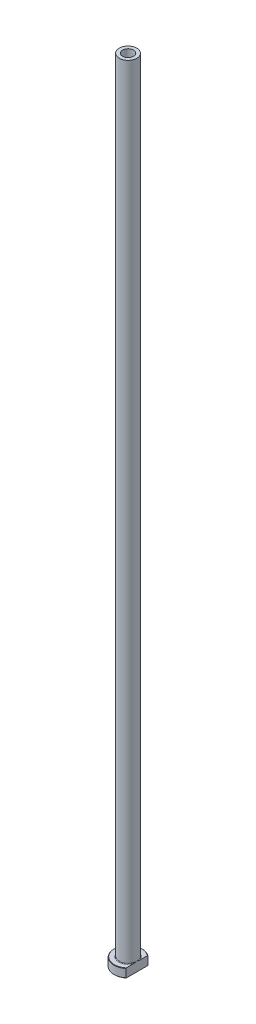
ISO-10303-21;
HEADER;
FILE_DESCRIPTION(('STEP AP214'),'2;1');
FILE_NAME('part.step','',(''),(''),'','','');
FILE_SCHEMA(('AUTOMOTIVE_DESIGN { 1 0 10303 214 1 1 1 1 }'));
ENDSEC;
DATA;
#1=APPLICATION_CONTEXT('core data for automotive mechanical design processes');
#2=APPLICATION_PROTOCOL_DEFINITION('international standard','automotive_design',2000,#1);
#3=PRODUCT_CONTEXT('',#1,'mechanical');
#4=PRODUCT('Part','Part','',(#3));
#5=PRODUCT_RELATED_PRODUCT_CATEGORY('part','',(#4));
#6=PRODUCT_DEFINITION_FORMATION('','',#4);
#7=PRODUCT_DEFINITION_CONTEXT('part definition',#1,'design');
#8=PRODUCT_DEFINITION('design','',#6,#7);
#9=PRODUCT_DEFINITION_SHAPE('','',#8);
#10=(LENGTH_UNIT() NAMED_UNIT(*) SI_UNIT(.MILLI.,.METRE.));
#11=(NAMED_UNIT(*) PLANE_ANGLE_UNIT() SI_UNIT($,.RADIAN.));
#12=(NAMED_UNIT(*) SI_UNIT($,.STERADIAN.) SOLID_ANGLE_UNIT());
#13=UNCERTAINTY_MEASURE_WITH_UNIT(LENGTH_MEASURE(1.E-05),#10,'distance_accuracy_value','');
#14=(GEOMETRIC_REPRESENTATION_CONTEXT(3) GLOBAL_UNCERTAINTY_ASSIGNED_CONTEXT((#13)) GLOBAL_UNIT_ASSIGNED_CONTEXT((#10,
#11,#12)) REPRESENTATION_CONTEXT('',''));
#15=CARTESIAN_POINT('',(0.,0.,0.));
#16=DIRECTION('',(0.,0.,1.));
#17=DIRECTION('',(1.,0.,0.));
#18=AXIS2_PLACEMENT_3D('',#15,#16,#17);
#19=CARTESIAN_POINT('',(0.,92.1876809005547,0.));
#20=DIRECTION('',(0.,1.,0.));
#21=DIRECTION('',(0.,0.,1.));
#22=AXIS2_PLACEMENT_3D('',#19,#20,#21);
#23=CYLINDRICAL_SURFACE('',#22,3.10000000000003);
#24=CARTESIAN_POINT('',(0.,450.,0.));
#25=DIRECTION('',(0.,1.,0.));
#26=DIRECTION('',(0.,0.,1.));
#27=AXIS2_PLACEMENT_3D('',#24,#25,#26);
#28=CIRCLE('',#27,3.10000000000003);
#29=CARTESIAN_POINT('',(0.,450.,3.10000000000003));
#30=VERTEX_POINT('',#29);
#31=EDGE_CURVE('E167',#30,#30,#28,.T.);
#32=ORIENTED_EDGE('',*,*,#31,.T.);
#33=EDGE_LOOP('',(#32));
#34=FACE_BOUND('',#33,.T.);
#35=CARTESIAN_POINT('',(0.,405.,0.));
#36=DIRECTION('',(0.,1.,0.));
#37=DIRECTION('',(0.,0.,1.));
#38=AXIS2_PLACEMENT_3D('',#35,#36,#37);
#39=CIRCLE('',#38,3.10000000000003);
#40=CARTESIAN_POINT('',(0.,405.,3.10000000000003));
#41=VERTEX_POINT('',#40);
#42=EDGE_CURVE('E170',#41,#41,#39,.T.);
#43=ORIENTED_EDGE('',*,*,#42,.F.);
#44=EDGE_LOOP('',(#43));
#45=FACE_BOUND('',#44,.T.);
#46=ADVANCED_FACE('F32',(#34,#45),#23,.F.);
#47=CARTESIAN_POINT('',(-3.10000000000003,450.,0.));
#48=DIRECTION('',(0.,1.,0.));
#49=DIRECTION('',(0.,0.,1.));
#50=AXIS2_PLACEMENT_3D('',#47,#48,#49);
#51=PLANE('',#50);
#52=CARTESIAN_POINT('',(0.,450.,0.));
#53=DIRECTION('',(0.,1.,0.));
#54=DIRECTION('',(0.,0.,1.));
#55=AXIS2_PLACEMENT_3D('',#52,#53,#54);
#56=CIRCLE('',#55,5.00000000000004);
#57=CARTESIAN_POINT('',(0.,450.,5.00000000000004));
#58=VERTEX_POINT('',#57);
#59=EDGE_CURVE('E174',#58,#58,#56,.T.);
#60=ORIENTED_EDGE('',*,*,#59,.T.);
#61=EDGE_LOOP('',(#60));
#62=FACE_BOUND('',#61,.T.);
#63=ORIENTED_EDGE('',*,*,#31,.F.);
#64=EDGE_LOOP('',(#63));
#65=FACE_BOUND('',#64,.T.);
#66=ADVANCED_FACE('F157',(#62,#65),#51,.T.);
#67=CARTESIAN_POINT('',(0.,92.1876809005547,0.));
#68=DIRECTION('',(0.,1.,0.));
#69=DIRECTION('',(0.,0.,1.));
#70=AXIS2_PLACEMENT_3D('',#67,#68,#69);
#71=CYLINDRICAL_SURFACE('',#70,5.00000000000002);
#72=CARTESIAN_POINT('',(0.,5.3,0.));
#73=DIRECTION('',(0.,1.,0.));
#74=DIRECTION('',(0.,0.,1.));
#75=AXIS2_PLACEMENT_3D('',#72,#73,#74);
#76=CIRCLE('',#75,5.00000000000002);
#77=CARTESIAN_POINT('',(5.00000000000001,5.3,0.));
#78=VERTEX_POINT('',#77);
#79=EDGE_CURVE('E180',#78,#78,#76,.T.);
#80=ORIENTED_EDGE('',*,*,#79,.T.);
#81=EDGE_LOOP('',(#80));
#82=FACE_BOUND('',#81,.T.);
#83=ORIENTED_EDGE('',*,*,#59,.F.);
#84=EDGE_LOOP('',(#83));
#85=FACE_BOUND('',#84,.T.);
#86=ADVANCED_FACE('F162',(#82,#85),#71,.T.);
#87=CARTESIAN_POINT('',(-4.99999999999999,5.,0.));
#88=DIRECTION('',(0.,1.,0.));
#89=DIRECTION('',(0.,0.,1.));
#90=AXIS2_PLACEMENT_3D('',#87,#88,#89);
#91=PLANE('',#90);
#92=DIRECTION('',(0.,0.,1.));
#93=VECTOR('',#92,1.);
#94=CARTESIAN_POINT('',(5.,5.,0.));
#95=LINE('',#94,#93);
#96=CARTESIAN_POINT('',(5.,5.,-5.98665181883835));
#97=VERTEX_POINT('',#96);
#98=CARTESIAN_POINT('',(5.,5.,-1.75783958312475));
#99=VERTEX_POINT('',#98);
#100=EDGE_CURVE('E54',#97,#99,#95,.T.);
#101=ORIENTED_EDGE('',*,*,#100,.F.);
#102=CARTESIAN_POINT('',(0.,5.,0.));
#103=DIRECTION('',(0.,1.,0.));
#104=DIRECTION('',(0.,0.,1.));
#105=AXIS2_PLACEMENT_3D('',#102,#103,#104);
#106=CIRCLE('',#105,7.80000000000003);
#107=CARTESIAN_POINT('',(4.99999999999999,5.,5.98665181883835));
#108=VERTEX_POINT('',#107);
#109=EDGE_CURVE('E186',#97,#108,#106,.T.);
#110=ORIENTED_EDGE('',*,*,#109,.T.);
#111=CARTESIAN_POINT('',(5.,5.,1.75783958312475));
#112=VERTEX_POINT('',#111);
#113=EDGE_CURVE('E134',#112,#108,#95,.T.);
#114=ORIENTED_EDGE('',*,*,#113,.F.);
#115=CARTESIAN_POINT('',(0.,5.,0.));
#116=DIRECTION('',(0.,1.,0.));
#117=DIRECTION('',(0.,0.,1.));
#118=AXIS2_PLACEMENT_3D('',#115,#116,#117);
#119=CIRCLE('',#118,5.30000000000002);
#120=EDGE_CURVE('E183',#112,#99,#119,.F.);
#121=ORIENTED_EDGE('',*,*,#120,.T.);
#122=EDGE_LOOP('',(#101,#110,#114,#121));
#123=FACE_BOUND('',#122,.T.);
#124=ADVANCED_FACE('F197',(#123),#91,.T.);
#125=CARTESIAN_POINT('',(0.,92.1876809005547,0.));
#126=DIRECTION('',(0.,1.,0.));
#127=DIRECTION('',(0.,0.,1.));
#128=AXIS2_PLACEMENT_3D('',#125,#126,#127);
#129=CYLINDRICAL_SURFACE('',#128,7.99999999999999);
#130=DIRECTION('',(0.,-1.,0.));
#131=VECTOR('',#130,1.);
#132=CARTESIAN_POINT('',(4.99999999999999,450.,6.24499799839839));
#133=LINE('',#132,#131);
#134=CARTESIAN_POINT('',(4.99999999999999,4.80000000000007,6.24499799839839));
#135=VERTEX_POINT('',#134);
#136=CARTESIAN_POINT('',(4.99999999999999,0.200000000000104,6.24499799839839));
#137=VERTEX_POINT('',#136);
#138=EDGE_CURVE('E82',#135,#137,#133,.T.);
#139=ORIENTED_EDGE('',*,*,#138,.F.);
#140=CARTESIAN_POINT('',(0.,4.80000000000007,0.));
#141=DIRECTION('',(0.,1.,0.));
#142=DIRECTION('',(0.,0.,1.));
#143=AXIS2_PLACEMENT_3D('',#140,#141,#142);
#144=CIRCLE('',#143,7.99999999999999);
#145=CARTESIAN_POINT('',(5.,4.80000000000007,-6.24499799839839));
#146=VERTEX_POINT('',#145);
#147=EDGE_CURVE('E95',#135,#146,#144,.F.);
#148=ORIENTED_EDGE('',*,*,#147,.T.);
#149=DIRECTION('',(0.,-1.,0.));
#150=VECTOR('',#149,1.);
#151=CARTESIAN_POINT('',(5.,450.,-6.24499799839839));
#152=LINE('',#151,#150);
#153=CARTESIAN_POINT('',(5.,0.200000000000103,-6.24499799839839));
#154=VERTEX_POINT('',#153);
#155=EDGE_CURVE('E192',#146,#154,#152,.T.);
#156=ORIENTED_EDGE('',*,*,#155,.T.);
#157=CARTESIAN_POINT('',(0.,0.200000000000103,0.));
#158=DIRECTION('',(0.,-1.,0.));
#159=DIRECTION('',(0.,0.,-1.));
#160=AXIS2_PLACEMENT_3D('',#157,#158,#159);
#161=CIRCLE('',#160,7.99999999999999);
#162=EDGE_CURVE('E98',#154,#137,#161,.F.);
#163=ORIENTED_EDGE('',*,*,#162,.T.);
#164=EDGE_LOOP('',(#139,#148,#156,#163));
#165=FACE_BOUND('',#164,.T.);
#166=ADVANCED_FACE('F190',(#165),#129,.T.);
#167=CARTESIAN_POINT('',(-7.99999999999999,0.,0.));
#168=DIRECTION('',(0.,-1.,0.));
#169=DIRECTION('',(0.,0.,-1.));
#170=AXIS2_PLACEMENT_3D('',#167,#168,#169);
#171=PLANE('',#170);
#172=CARTESIAN_POINT('',(0.,0.,0.));
#173=DIRECTION('',(0.,-1.,0.));
#174=DIRECTION('',(0.,0.,-1.));
#175=AXIS2_PLACEMENT_3D('',#172,#173,#174);
#176=CIRCLE('',#175,3.85000000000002);
#177=CARTESIAN_POINT('',(0.,0.,-3.85000000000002));
#178=VERTEX_POINT('',#177);
#179=EDGE_CURVE('E40',#178,#178,#176,.F.);
#180=ORIENTED_EDGE('',*,*,#179,.T.);
#181=EDGE_LOOP('',(#180));
#182=FACE_BOUND('',#181,.T.);
#183=DIRECTION('',(0.,0.,-1.));
#184=VECTOR('',#183,1.);
#185=CARTESIAN_POINT('',(4.99999999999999,0.,6.24499799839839));
#186=LINE('',#185,#184);
#187=CARTESIAN_POINT('',(4.99999999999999,0.,5.9866518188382));
#188=VERTEX_POINT('',#187);
#189=CARTESIAN_POINT('',(5.,0.,-5.9866518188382));
#190=VERTEX_POINT('',#189);
#191=EDGE_CURVE('E47',#188,#190,#186,.T.);
#192=ORIENTED_EDGE('',*,*,#191,.F.);
#193=CARTESIAN_POINT('',(0.,0.,0.));
#194=DIRECTION('',(0.,-1.,0.));
#195=DIRECTION('',(0.,0.,-1.));
#196=AXIS2_PLACEMENT_3D('',#193,#194,#195);
#197=CIRCLE('',#196,7.79999999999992);
#198=EDGE_CURVE('E92',#188,#190,#197,.T.);
#199=ORIENTED_EDGE('',*,*,#198,.T.);
#200=EDGE_LOOP('',(#192,#199));
#201=FACE_BOUND('',#200,.T.);
#202=ADVANCED_FACE('F91',(#182,#201),#171,.T.);
#203=CARTESIAN_POINT('',(0.,92.1876809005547,0.));
#204=DIRECTION('',(0.,1.,0.));
#205=DIRECTION('',(0.,0.,1.));
#206=AXIS2_PLACEMENT_3D('',#203,#204,#205);
#207=CYLINDRICAL_SURFACE('',#206,3.35000000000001);
#208=CARTESIAN_POINT('',(0.,0.5,0.));
#209=DIRECTION('',(0.,-1.,0.));
#210=DIRECTION('',(0.,0.,-1.));
#211=AXIS2_PLACEMENT_3D('',#208,#209,#210);
#212=CIRCLE('',#211,3.35000000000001);
#213=CARTESIAN_POINT('',(0.,0.5,-3.35000000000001));
#214=VERTEX_POINT('',#213);
#215=EDGE_CURVE('E11',#214,#214,#212,.T.);
#216=ORIENTED_EDGE('',*,*,#215,.T.);
#217=EDGE_LOOP('',(#216));
#218=FACE_BOUND('',#217,.T.);
#219=CARTESIAN_POINT('',(0.,393.,0.));
#220=DIRECTION('',(0.,1.,0.));
#221=DIRECTION('',(0.,0.,1.));
#222=AXIS2_PLACEMENT_3D('',#219,#220,#221);
#223=CIRCLE('',#222,3.35000000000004);
#224=CARTESIAN_POINT('',(0.,393.,3.35000000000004));
#225=VERTEX_POINT('',#224);
#226=EDGE_CURVE('E172',#225,#225,#223,.T.);
#227=ORIENTED_EDGE('',*,*,#226,.T.);
#228=EDGE_LOOP('',(#227));
#229=FACE_BOUND('',#228,.T.);
#230=ADVANCED_FACE('F215',(#218,#229),#207,.F.);
#231=CARTESIAN_POINT('',(0.,393.,0.));
#232=DIRECTION('',(0.,-1.,0.));
#233=DIRECTION('',(0.,0.,-1.));
#234=AXIS2_PLACEMENT_3D('',#231,#232,#233);
#235=CONICAL_SURFACE('',#234,3.35000000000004,0.0208303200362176);
#236=ORIENTED_EDGE('',*,*,#42,.T.);
#237=EDGE_LOOP('',(#236));
#238=FACE_BOUND('',#237,.T.);
#239=ORIENTED_EDGE('',*,*,#226,.F.);
#240=EDGE_LOOP('',(#239));
#241=FACE_BOUND('',#240,.T.);
#242=ADVANCED_FACE('F111',(#238,#241),#235,.F.);
#243=CARTESIAN_POINT('',(0.,5.3,0.));
#244=DIRECTION('',(0.,1.,0.));
#245=DIRECTION('',(0.,0.,1.));
#246=AXIS2_PLACEMENT_3D('',#243,#244,#245);
#247=TOROIDAL_SURFACE('',#246,5.30000000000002,0.3);
#248=ORIENTED_EDGE('',*,*,#120,.F.);
#249=CARTESIAN_POINT('',(5.00000000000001,5.3,0.));
#250=CARTESIAN_POINT('',(5.00000000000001,5.30000062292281,-1.31469187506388E-10));
#251=CARTESIAN_POINT('',(5.00000000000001,5.30000124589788,2.52759590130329E-07));
#252=CARTESIAN_POINT('',(5.00000000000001,5.30000240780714,9.47165111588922E-07));
#253=CARTESIAN_POINT('',(5.00000000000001,5.30000293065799,1.40594123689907E-06));
#254=CARTESIAN_POINT('',(5.00000000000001,5.30000402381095,2.50637727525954E-06));
#255=CARTESIAN_POINT('',(5.00000000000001,5.30000457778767,3.16589056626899E-06));
#256=CARTESIAN_POINT('',(5.00000000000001,5.30000556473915,4.52860131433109E-06));
#257=CARTESIAN_POINT('',(5.00000000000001,5.30000600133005,5.22939602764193E-06));
#258=CARTESIAN_POINT('',(5.00000000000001,5.30000763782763,7.96122246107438E-06));
#259=CARTESIAN_POINT('',(5.00000000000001,5.30000875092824,1.00477443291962E-05));
#260=CARTESIAN_POINT('',(5.00000000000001,5.30001056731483,1.41660911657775E-05));
#261=CARTESIAN_POINT('',(5.00000000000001,5.3000112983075,1.61861817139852E-05));
#262=CARTESIAN_POINT('',(5.,5.30001439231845,2.47865797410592E-05));
#263=CARTESIAN_POINT('',(5.,5.30001672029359,3.13830361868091E-05));
#264=CARTESIAN_POINT('',(5.,5.30002012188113,4.38084310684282E-05));
#265=CARTESIAN_POINT('',(5.,5.30002133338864,4.95992819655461E-05));
#266=CARTESIAN_POINT('',(5.,5.30003020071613,9.27862738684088E-05));
#267=CARTESIAN_POINT('',(5.,5.30003696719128,0.000130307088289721));
#268=CARTESIAN_POINT('',(4.99999999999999,5.30006659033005,0.000278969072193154));
#269=CARTESIAN_POINT('',(4.99999999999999,5.30009481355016,0.000389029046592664));
#270=CARTESIAN_POINT('',(5.,5.3002050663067,0.000826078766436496));
#271=CARTESIAN_POINT('',(5.,5.3002836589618,0.00115365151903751));
#272=CARTESIAN_POINT('',(4.99999999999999,5.30059919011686,0.00245925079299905));
#273=CARTESIAN_POINT('',(4.99999999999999,5.30084048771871,0.00343651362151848));
#274=CARTESIAN_POINT('',(5.,5.30184626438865,0.00752058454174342));
#275=CARTESIAN_POINT('',(5.,5.30260525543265,0.0106283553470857));
#276=CARTESIAN_POINT('',(4.99999999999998,5.30996461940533,0.0407482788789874));
#277=CARTESIAN_POINT('',(4.99999999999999,5.31658985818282,0.0677561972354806));
#278=CARTESIAN_POINT('',(5.,5.32953319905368,0.120688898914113));
#279=CARTESIAN_POINT('',(5.,5.33585289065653,0.146613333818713));
#280=CARTESIAN_POINT('',(4.99999999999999,5.3492605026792,0.201795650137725));
#281=CARTESIAN_POINT('',(4.99999999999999,5.35634306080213,0.231054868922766));
#282=CARTESIAN_POINT('',(5.,5.37050252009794,0.289917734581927));
#283=CARTESIAN_POINT('',(5.,5.37757848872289,0.319521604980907));
#284=CARTESIAN_POINT('',(5.,5.39452602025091,0.391032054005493));
#285=CARTESIAN_POINT('',(5.,5.40434071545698,0.432952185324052));
#286=CARTESIAN_POINT('',(5.,5.42340141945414,0.515763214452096));
#287=CARTESIAN_POINT('',(5.,5.43265559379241,0.556652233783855));
#288=CARTESIAN_POINT('',(5.,5.45710553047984,0.667075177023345));
#289=CARTESIAN_POINT('',(5.,5.4719417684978,0.736689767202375));
#290=CARTESIAN_POINT('',(5.,5.50018229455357,0.876836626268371));
#291=CARTESIAN_POINT('',(5.,5.51357312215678,0.947371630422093));
#292=CARTESIAN_POINT('',(5.,5.53930921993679,1.09497328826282));
#293=CARTESIAN_POINT('',(5.,5.55146217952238,1.17207432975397));
#294=CARTESIAN_POINT('',(5.,5.57239669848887,1.32672649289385));
#295=CARTESIAN_POINT('',(5.,5.58117877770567,1.40427754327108));
#296=CARTESIAN_POINT('',(5.,5.5949972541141,1.56873827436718));
#297=CARTESIAN_POINT('',(5.,5.5994880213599,1.65570044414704));
#298=CARTESIAN_POINT('',(5.,5.60018885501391,1.78535304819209));
#299=CARTESIAN_POINT('',(5.,5.59945214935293,1.82802575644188));
#300=CARTESIAN_POINT('',(5.,5.59559364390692,1.91325081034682));
#301=CARTESIAN_POINT('',(5.,5.59247319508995,1.95580321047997));
#302=CARTESIAN_POINT('',(5.,5.58383242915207,2.03512365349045));
#303=CARTESIAN_POINT('',(5.,5.57867386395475,2.0719293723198));
#304=CARTESIAN_POINT('',(5.,5.56543793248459,2.1452675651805));
#305=CARTESIAN_POINT('',(5.,5.55734203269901,2.18179676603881));
#306=CARTESIAN_POINT('',(5.,5.53718005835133,2.25427226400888));
#307=CARTESIAN_POINT('',(5.,5.52507057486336,2.29020746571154));
#308=CARTESIAN_POINT('',(5.,5.50270928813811,2.34223029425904));
#309=CARTESIAN_POINT('',(5.,5.49457811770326,2.35922314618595));
#310=CARTESIAN_POINT('',(5.,5.47657809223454,2.39224900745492));
#311=CARTESIAN_POINT('',(5.,5.46671281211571,2.40828390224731));
#312=CARTESIAN_POINT('',(5.,5.4469589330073,2.435794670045));
#313=CARTESIAN_POINT('',(5.,5.43745879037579,2.44754592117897));
#314=CARTESIAN_POINT('',(5.,5.41677914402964,2.46946476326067));
#315=CARTESIAN_POINT('',(5.,5.40560543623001,2.47963758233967));
#316=CARTESIAN_POINT('',(5.,5.38617750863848,2.49393642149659));
#317=CARTESIAN_POINT('',(5.,5.37851643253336,2.4988627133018));
#318=CARTESIAN_POINT('',(5.,5.36252740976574,2.50749953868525));
#319=CARTESIAN_POINT('',(5.,5.35419984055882,2.51121075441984));
#320=CARTESIAN_POINT('',(5.,5.33690648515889,2.51712941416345));
#321=CARTESIAN_POINT('',(5.,5.32793451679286,2.51931927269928));
#322=CARTESIAN_POINT('',(5.,5.30973576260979,2.52185978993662));
#323=CARTESIAN_POINT('',(5.,5.30050931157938,2.52221275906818));
#324=CARTESIAN_POINT('',(5.,5.28349166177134,2.52112455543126));
#325=CARTESIAN_POINT('',(5.,5.275683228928,2.51993178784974));
#326=CARTESIAN_POINT('',(5.,5.2603686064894,2.51628294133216));
#327=CARTESIAN_POINT('',(5.,5.25286261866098,2.51382603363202));
#328=CARTESIAN_POINT('',(5.,5.23590266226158,2.5068548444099));
#329=CARTESIAN_POINT('',(5.,5.22661875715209,2.5019298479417));
#330=CARTESIAN_POINT('',(5.,5.20895514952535,2.49066548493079));
#331=CARTESIAN_POINT('',(5.,5.20057756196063,2.48432291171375));
#332=CARTESIAN_POINT('',(5.,5.17987008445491,2.46645212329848));
#333=CARTESIAN_POINT('',(5.,5.16824151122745,2.4541186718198));
#334=CARTESIAN_POINT('',(5.,5.14692461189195,2.42790849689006));
#335=CARTESIAN_POINT('',(5.,5.13723987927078,2.41402898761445));
#336=CARTESIAN_POINT('',(5.,5.11080706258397,2.37143175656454));
#337=CARTESIAN_POINT('',(5.,5.09628770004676,2.34134703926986));
#338=CARTESIAN_POINT('',(5.,5.07130349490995,2.27940731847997));
#339=CARTESIAN_POINT('',(5.,5.06087110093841,2.24754035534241));
#340=CARTESIAN_POINT('',(5.,5.0389035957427,2.16787245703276));
#341=CARTESIAN_POINT('',(5.,5.02913523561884,2.11959065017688));
#342=CARTESIAN_POINT('',(5.,5.01416953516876,2.02224928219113));
#343=CARTESIAN_POINT('',(5.,5.00898637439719,1.97318778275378));
#344=CARTESIAN_POINT('',(5.,5.00220823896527,1.87635767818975));
#345=CARTESIAN_POINT('',(5.,5.0005070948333,1.82859609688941));
#346=CARTESIAN_POINT('',(5.,4.99969104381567,1.73330165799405));
#347=CARTESIAN_POINT('',(5.,5.00056327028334,1.68576884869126));
#348=CARTESIAN_POINT('',(5.,5.0048429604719,1.57937770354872));
#349=CARTESIAN_POINT('',(5.,5.00880932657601,1.52054285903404));
#350=CARTESIAN_POINT('',(5.,5.01925964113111,1.40312974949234));
#351=CARTESIAN_POINT('',(5.,5.02574264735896,1.34455139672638));
#352=CARTESIAN_POINT('',(5.,5.04090087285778,1.22627662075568));
#353=CARTESIAN_POINT('',(5.,5.04962425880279,1.16658647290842));
#354=CARTESIAN_POINT('',(5.,5.06877923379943,1.04732463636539));
#355=CARTESIAN_POINT('',(5.,5.07921523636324,0.987753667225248));
#356=CARTESIAN_POINT('',(5.,5.10551698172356,0.846936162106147));
#357=CARTESIAN_POINT('',(4.99999999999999,5.12196565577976,0.765799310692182));
#358=CARTESIAN_POINT('',(5.,5.15639716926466,0.604819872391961));
#359=CARTESIAN_POINT('',(5.,5.1743605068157,0.524973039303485));
#360=CARTESIAN_POINT('',(4.99999999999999,5.20921667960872,0.374726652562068));
#361=CARTESIAN_POINT('',(4.99999999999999,5.22599388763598,0.30430004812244));
#362=CARTESIAN_POINT('',(5.,5.25191105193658,0.196907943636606));
#363=CARTESIAN_POINT('',(5.,5.26090146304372,0.15990571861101));
#364=CARTESIAN_POINT('',(4.99999999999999,5.27881854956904,0.0865164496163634));
#365=CARTESIAN_POINT('',(4.99999999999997,5.28774391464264,0.0501291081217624));
#366=CARTESIAN_POINT('',(5.,5.29739627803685,0.0106218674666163));
#367=CARTESIAN_POINT('',(5.,5.29815688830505,0.0075076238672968));
#368=CARTESIAN_POINT('',(4.99999999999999,5.29916304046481,0.00342209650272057));
#369=CARTESIAN_POINT('',(4.99999999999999,5.299403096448,0.00244985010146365));
#370=CARTESIAN_POINT('',(5.,5.29971711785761,0.00115049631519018));
#371=CARTESIAN_POINT('',(5.,5.29979541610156,0.000824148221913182));
#372=CARTESIAN_POINT('',(4.99999999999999,5.29990531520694,0.000388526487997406));
#373=CARTESIAN_POINT('',(4.99999999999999,5.29993348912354,0.000278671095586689));
#374=CARTESIAN_POINT('',(5.,5.29996306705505,0.000130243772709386));
#375=CARTESIAN_POINT('',(5.,5.29996982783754,9.27511503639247E-05));
#376=CARTESIAN_POINT('',(5.,5.2999786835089,4.9592997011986E-05));
#377=CARTESIAN_POINT('',(5.,5.29997989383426,4.38036645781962E-05));
#378=CARTESIAN_POINT('',(5.,5.29998329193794,3.13814263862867E-05));
#379=CARTESIAN_POINT('',(5.,5.29998561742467,2.47865276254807E-05));
#380=CARTESIAN_POINT('',(5.00000000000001,5.29998870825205,1.61877580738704E-05));
#381=CARTESIAN_POINT('',(5.00000000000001,5.29998943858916,1.41677806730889E-05));
#382=CARTESIAN_POINT('',(5.00000000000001,5.29999125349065,1.00495564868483E-05));
#383=CARTESIAN_POINT('',(5.00000000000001,5.29999236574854,7.96302921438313E-06));
#384=CARTESIAN_POINT('',(5.00000000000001,5.29999400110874,5.23107573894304E-06));
#385=CARTESIAN_POINT('',(5.00000000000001,5.29999443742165,4.53021200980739E-06));
#386=CARTESIAN_POINT('',(5.00000000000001,5.29999542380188,3.16731304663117E-06));
#387=CARTESIAN_POINT('',(5.00000000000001,5.29999597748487,2.50767848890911E-06));
#388=CARTESIAN_POINT('',(5.00000000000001,5.29999707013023,1.40695965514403E-06));
#389=CARTESIAN_POINT('',(5.00000000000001,5.29999759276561,9.48033218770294E-07));
#390=CARTESIAN_POINT('',(5.00000000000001,5.29999875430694,2.53244699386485E-07));
#391=CARTESIAN_POINT('',(5.00000000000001,5.29999937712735,1.31459989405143E-10));
#392=CARTESIAN_POINT('',(5.00000000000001,5.3,0.));
#393=B_SPLINE_CURVE_WITH_KNOTS('',3,(#249,#250,#251,#252,#253,#254,#255,#256,#257,#258,#259,
#260,#261,#262,#263,#264,#265,#266,#267,#268,#269,#270,#271,#272,#273,#274,#275,#276,#277,#278,
#279,#280,#281,#282,#283,#284,#285,#286,#287,#288,#289,#290,#291,#292,#293,#294,#295,#296,#297,
#298,#299,#300,#301,#302,#303,#304,#305,#306,#307,#308,#309,#310,#311,#312,#313,#314,#315,#316,
#317,#318,#319,#320,#321,#322,#323,#324,#325,#326,#327,#328,#329,#330,#331,#332,#333,#334,#335,
#336,#337,#338,#339,#340,#341,#342,#343,#344,#345,#346,#347,#348,#349,#350,#351,#352,#353,#354,
#355,#356,#357,#358,#359,#360,#361,#362,#363,#364,#365,#366,#367,#368,#369,#370,#371,#372,#373,
#374,#375,#376,#377,#378,#379,#380,#381,#382,#383,#384,#385,#386,#387,#388,#389,#390,#391,#392),
.UNSPECIFIED.,.T.,.F.,(4,2,2,2,2,2,2,2,2,2,2,2,2,2,2,2,2,2,2,2,2,2,2,2,2,2,2,2,2,2,2,2,2,2,2,2,
2,2,2,2,2,2,2,2,2,2,2,2,2,2,2,2,2,2,2,2,2,2,2,2,2,2,2,2,2,2,2,2,2,2,2,4),(0.,
1.88938864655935E-06,3.98058112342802E-06,6.54817547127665E-06,9.02403102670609E-06,
1.609386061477E-05,2.25328014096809E-05,4.34843749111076E-05,6.12119972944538E-05,
0.000175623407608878,0.000516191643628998,0.00152710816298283,0.00454656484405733,
0.0141443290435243,0.0975679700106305,0.177619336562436,0.2679317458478,0.359245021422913,
0.488405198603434,0.614173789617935,0.827694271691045,1.04305715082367,1.27715608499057,
1.51121890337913,1.77214751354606,1.90013509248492,2.02805018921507,2.13945459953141,
2.25157451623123,2.3649489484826,2.42139235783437,2.47772074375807,2.5229380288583,
2.56800219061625,2.59524342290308,2.62246933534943,2.65000494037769,2.67750590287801,
2.70108948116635,2.72468854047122,2.75603978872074,2.78746268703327,2.83802806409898,
2.88868607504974,2.98834295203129,3.08877575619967,3.23618650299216,3.3840515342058,
3.52733651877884,3.66990630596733,3.84673903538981,4.02350562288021,4.20444776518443,
4.38586374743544,4.63419556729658,4.87971270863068,5.09690175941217,5.21113882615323,
5.32353360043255,5.33315137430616,5.33615533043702,5.33716246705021,5.33750240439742,
5.33761672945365,5.33763445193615,5.33765539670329,5.33766183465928,5.33766890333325,
5.33767137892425,5.33767394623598,5.33767603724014,5.33767792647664),.UNSPECIFIED.);
#394=EDGE_CURVE('E126',#112,#78,#393,.T.);
#395=ORIENTED_EDGE('',*,*,#394,.T.);
#396=ORIENTED_EDGE('',*,*,#79,.F.);
#397=CARTESIAN_POINT('',(5.00000000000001,5.3,0.));
#398=CARTESIAN_POINT('',(5.00000000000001,5.29999937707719,1.31470630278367E-10));
#399=CARTESIAN_POINT('',(5.00000000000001,5.29999875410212,-2.52759588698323E-07));
#400=CARTESIAN_POINT('',(5.00000000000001,5.29999759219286,-9.47165110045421E-07));
#401=CARTESIAN_POINT('',(5.00000000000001,5.29999706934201,-1.40594123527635E-06));
#402=CARTESIAN_POINT('',(5.00000000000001,5.29999597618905,-2.50637727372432E-06));
#403=CARTESIAN_POINT('',(5.00000000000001,5.29999542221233,-3.16589056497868E-06));
#404=CARTESIAN_POINT('',(5.00000000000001,5.29999443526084,-4.52860131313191E-06));
#405=CARTESIAN_POINT('',(5.00000000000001,5.29999399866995,-5.22939602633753E-06));
#406=CARTESIAN_POINT('',(5.00000000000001,5.29999236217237,-7.96122245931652E-06));
#407=CARTESIAN_POINT('',(5.,5.29999124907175,-1.00477443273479E-05));
#408=CARTESIAN_POINT('',(5.,5.29998943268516,-1.41660911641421E-05));
#409=CARTESIAN_POINT('',(5.00000000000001,5.29998870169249,-1.6186181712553E-05));
#410=CARTESIAN_POINT('',(5.00000000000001,5.29998560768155,-2.47865797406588E-05));
#411=CARTESIAN_POINT('',(5.00000000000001,5.29998327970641,-3.13830361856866E-05));
#412=CARTESIAN_POINT('',(5.,5.29997987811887,-4.38084310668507E-05));
#413=CARTESIAN_POINT('',(5.,5.29997866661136,-4.95992819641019E-05));
#414=CARTESIAN_POINT('',(5.,5.29996979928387,-9.27862738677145E-05));
#415=CARTESIAN_POINT('',(5.,5.29996303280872,-0.000130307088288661));
#416=CARTESIAN_POINT('',(4.99999999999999,5.29993340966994,-0.000278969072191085));
#417=CARTESIAN_POINT('',(4.99999999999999,5.29990518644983,-0.000389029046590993));
#418=CARTESIAN_POINT('',(5.,5.2997949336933,-0.000826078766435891));
#419=CARTESIAN_POINT('',(5.,5.2997163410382,-0.00115365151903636));
#420=CARTESIAN_POINT('',(4.99999999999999,5.29940080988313,-0.00245925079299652));
#421=CARTESIAN_POINT('',(4.99999999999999,5.29915951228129,-0.00343651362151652));
#422=CARTESIAN_POINT('',(5.,5.29815373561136,-0.00752058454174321));
#423=CARTESIAN_POINT('',(5.,5.29739474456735,-0.0106283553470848));
#424=CARTESIAN_POINT('',(4.99999999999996,5.29003538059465,-0.0407482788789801));
#425=CARTESIAN_POINT('',(4.99999999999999,5.28341014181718,-0.0677561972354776));
#426=CARTESIAN_POINT('',(5.,5.27046680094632,-0.120688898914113));
#427=CARTESIAN_POINT('',(5.,5.26414710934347,-0.146613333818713));
#428=CARTESIAN_POINT('',(4.99999999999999,5.25073949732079,-0.201795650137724));
#429=CARTESIAN_POINT('',(4.99999999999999,5.24365693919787,-0.231054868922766));
#430=CARTESIAN_POINT('',(5.,5.22949747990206,-0.289917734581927));
#431=CARTESIAN_POINT('',(5.,5.22242151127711,-0.319521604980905));
#432=CARTESIAN_POINT('',(5.,5.20547397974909,-0.39103205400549));
#433=CARTESIAN_POINT('',(5.,5.19565928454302,-0.432952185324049));
#434=CARTESIAN_POINT('',(5.,5.17659858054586,-0.515763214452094));
#435=CARTESIAN_POINT('',(5.,5.16734440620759,-0.556652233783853));
#436=CARTESIAN_POINT('',(5.,5.14289446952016,-0.667075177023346));
#437=CARTESIAN_POINT('',(5.,5.1280582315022,-0.736689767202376));
#438=CARTESIAN_POINT('',(5.,5.09981770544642,-0.876836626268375));
#439=CARTESIAN_POINT('',(5.,5.08642687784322,-0.947371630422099));
#440=CARTESIAN_POINT('',(5.,5.06069078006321,-1.09497328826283));
#441=CARTESIAN_POINT('',(5.,5.04853782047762,-1.17207432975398));
#442=CARTESIAN_POINT('',(5.,5.02760330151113,-1.32672649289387));
#443=CARTESIAN_POINT('',(5.,5.01882122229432,-1.4042775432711));
#444=CARTESIAN_POINT('',(5.,5.0050027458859,-1.56873827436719));
#445=CARTESIAN_POINT('',(5.,5.0005119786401,-1.65570044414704));
#446=CARTESIAN_POINT('',(5.,4.99981114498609,-1.78535304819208));
#447=CARTESIAN_POINT('',(5.,5.00054785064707,-1.82802575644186));
#448=CARTESIAN_POINT('',(5.,5.00440635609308,-1.9132508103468));
#449=CARTESIAN_POINT('',(5.,5.00752680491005,-1.95580321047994));
#450=CARTESIAN_POINT('',(5.,5.01616757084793,-2.03512365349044));
#451=CARTESIAN_POINT('',(5.,5.02132613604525,-2.0719293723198));
#452=CARTESIAN_POINT('',(5.,5.03456206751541,-2.14526756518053));
#453=CARTESIAN_POINT('',(5.,5.042657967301,-2.18179676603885));
#454=CARTESIAN_POINT('',(5.,5.06281994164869,-2.25427226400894));
#455=CARTESIAN_POINT('',(5.,5.07492942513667,-2.29020746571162));
#456=CARTESIAN_POINT('',(5.,5.09729071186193,-2.34223029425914));
#457=CARTESIAN_POINT('',(5.,5.10542188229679,-2.35922314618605));
#458=CARTESIAN_POINT('',(5.,5.12342190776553,-2.39224900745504));
#459=CARTESIAN_POINT('',(5.,5.13328718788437,-2.40828390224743));
#460=CARTESIAN_POINT('',(5.,5.15304106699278,-2.43579467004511));
#461=CARTESIAN_POINT('',(5.,5.16254120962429,-2.44754592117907));
#462=CARTESIAN_POINT('',(5.,5.18322085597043,-2.46946476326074));
#463=CARTESIAN_POINT('',(5.,5.19439456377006,-2.47963758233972));
#464=CARTESIAN_POINT('',(5.,5.21382249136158,-2.49393642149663));
#465=CARTESIAN_POINT('',(5.,5.2214835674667,-2.49886271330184));
#466=CARTESIAN_POINT('',(5.,5.23747259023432,-2.50749953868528));
#467=CARTESIAN_POINT('',(5.,5.24580015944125,-2.51121075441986));
#468=CARTESIAN_POINT('',(5.,5.26309351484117,-2.51712941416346));
#469=CARTESIAN_POINT('',(5.,5.2720654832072,-2.51931927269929));
#470=CARTESIAN_POINT('',(5.,5.29026423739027,-2.52185978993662));
#471=CARTESIAN_POINT('',(5.,5.29949068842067,-2.52221275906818));
#472=CARTESIAN_POINT('',(5.,5.31650833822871,-2.52112455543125));
#473=CARTESIAN_POINT('',(5.,5.32431677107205,-2.51993178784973));
#474=CARTESIAN_POINT('',(5.,5.33963139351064,-2.51628294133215));
#475=CARTESIAN_POINT('',(5.,5.34713738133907,-2.513826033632));
#476=CARTESIAN_POINT('',(5.,5.36409733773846,-2.50685484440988));
#477=CARTESIAN_POINT('',(5.,5.37338124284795,-2.50192984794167));
#478=CARTESIAN_POINT('',(5.,5.39104485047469,-2.49066548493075));
#479=CARTESIAN_POINT('',(5.,5.39942243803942,-2.48432291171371));
#480=CARTESIAN_POINT('',(5.,5.42012991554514,-2.46645212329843));
#481=CARTESIAN_POINT('',(5.,5.43175848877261,-2.45411867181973));
#482=CARTESIAN_POINT('',(5.,5.45307538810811,-2.42790849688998));
#483=CARTESIAN_POINT('',(5.,5.46276012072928,-2.41402898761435));
#484=CARTESIAN_POINT('',(5.,5.4891929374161,-2.3714317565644));
#485=CARTESIAN_POINT('',(5.,5.50371229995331,-2.3413470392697));
#486=CARTESIAN_POINT('',(5.,5.52869650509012,-2.27940731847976));
#487=CARTESIAN_POINT('',(5.,5.53912889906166,-2.24754035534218));
#488=CARTESIAN_POINT('',(5.,5.56109640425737,-2.16787245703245));
#489=CARTESIAN_POINT('',(5.,5.57086476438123,-2.11959065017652));
#490=CARTESIAN_POINT('',(5.,5.58583046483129,-2.02224928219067));
#491=CARTESIAN_POINT('',(5.,5.59101362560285,-1.97318778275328));
#492=CARTESIAN_POINT('',(5.,5.59779176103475,-1.87635767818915));
#493=CARTESIAN_POINT('',(5.,5.59949290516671,-1.82859609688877));
#494=CARTESIAN_POINT('',(5.,5.60030895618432,-1.73330165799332));
#495=CARTESIAN_POINT('',(5.,5.59943672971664,-1.68576884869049));
#496=CARTESIAN_POINT('',(5.,5.59515703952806,-1.57937770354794));
#497=CARTESIAN_POINT('',(5.,5.59119067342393,-1.52054285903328));
#498=CARTESIAN_POINT('',(5.,5.58074035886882,-1.40312974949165));
#499=CARTESIAN_POINT('',(5.,5.57425735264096,-1.34455139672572));
#500=CARTESIAN_POINT('',(5.,5.55909912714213,-1.22627662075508));
#501=CARTESIAN_POINT('',(5.,5.55037574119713,-1.16658647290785));
#502=CARTESIAN_POINT('',(5.,5.53122076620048,-1.04732463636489));
#503=CARTESIAN_POINT('',(5.,5.52078476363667,-0.987753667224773));
#504=CARTESIAN_POINT('',(5.,5.49448301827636,-0.846936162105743));
#505=CARTESIAN_POINT('',(4.99999999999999,5.47803434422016,-0.765799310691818));
#506=CARTESIAN_POINT('',(5.,5.44360283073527,-0.604819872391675));
#507=CARTESIAN_POINT('',(5.,5.42563949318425,-0.524973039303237));
#508=CARTESIAN_POINT('',(4.99999999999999,5.39078332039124,-0.374726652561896));
#509=CARTESIAN_POINT('',(4.99999999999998,5.37400611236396,-0.304300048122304));
#510=CARTESIAN_POINT('',(5.,5.34808894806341,-0.196907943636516));
#511=CARTESIAN_POINT('',(5.00000000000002,5.33909853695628,-0.159905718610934));
#512=CARTESIAN_POINT('',(4.99999999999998,5.32118145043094,-0.08651644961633));
#513=CARTESIAN_POINT('',(4.99999999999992,5.3122560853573,-0.050129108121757));
#514=CARTESIAN_POINT('',(5.,5.30260372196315,-0.0106218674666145));
#515=CARTESIAN_POINT('',(5.00000000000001,5.30184311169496,-0.00750762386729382));
#516=CARTESIAN_POINT('',(4.99999999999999,5.30083695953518,-0.00342209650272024));
#517=CARTESIAN_POINT('',(4.99999999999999,5.30059690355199,-0.00244985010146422));
#518=CARTESIAN_POINT('',(5.,5.30028288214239,-0.0011504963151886));
#519=CARTESIAN_POINT('',(5.,5.30020458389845,-0.000824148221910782));
#520=CARTESIAN_POINT('',(4.99999999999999,5.30009468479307,-0.000388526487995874));
#521=CARTESIAN_POINT('',(4.99999999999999,5.30006651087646,-0.000278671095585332));
#522=CARTESIAN_POINT('',(5.,5.30003693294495,-0.000130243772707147));
#523=CARTESIAN_POINT('',(5.,5.30003017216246,-9.27511503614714E-05));
#524=CARTESIAN_POINT('',(5.,5.30002131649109,-4.95929970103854E-05));
#525=CARTESIAN_POINT('',(5.,5.30002010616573,-4.38036645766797E-05));
#526=CARTESIAN_POINT('',(5.,5.30001670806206,-3.13814263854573E-05));
#527=CARTESIAN_POINT('',(5.,5.30001438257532,-2.47865276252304E-05));
#528=CARTESIAN_POINT('',(5.,5.30001129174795,-1.61877580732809E-05));
#529=CARTESIAN_POINT('',(5.,5.30001056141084,-1.41677806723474E-05));
#530=CARTESIAN_POINT('',(5.,5.30000874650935,-1.00495564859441E-05));
#531=CARTESIAN_POINT('',(5.,5.30000763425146,-7.96302921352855E-06));
#532=CARTESIAN_POINT('',(5.00000000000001,5.30000599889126,-5.23107573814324E-06));
#533=CARTESIAN_POINT('',(5.00000000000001,5.30000556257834,-4.53021200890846E-06));
#534=CARTESIAN_POINT('',(5.00000000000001,5.30000457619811,-3.16731304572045E-06));
#535=CARTESIAN_POINT('',(5.00000000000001,5.30000402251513,-2.50767848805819E-06));
#536=CARTESIAN_POINT('',(5.00000000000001,5.30000292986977,-1.4069596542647E-06));
#537=CARTESIAN_POINT('',(5.00000000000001,5.30000240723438,-9.48033217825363E-07));
#538=CARTESIAN_POINT('',(5.00000000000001,5.30000124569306,-2.5324469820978E-07));
#539=CARTESIAN_POINT('',(5.00000000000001,5.30000062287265,-1.31458654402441E-10));
#540=CARTESIAN_POINT('',(5.00000000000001,5.3,0.));
#541=B_SPLINE_CURVE_WITH_KNOTS('',3,(#397,#398,#399,#400,#401,#402,#403,#404,#405,#406,#407,
#408,#409,#410,#411,#412,#413,#414,#415,#416,#417,#418,#419,#420,#421,#422,#423,#424,#425,#426,
#427,#428,#429,#430,#431,#432,#433,#434,#435,#436,#437,#438,#439,#440,#441,#442,#443,#444,#445,
#446,#447,#448,#449,#450,#451,#452,#453,#454,#455,#456,#457,#458,#459,#460,#461,#462,#463,#464,
#465,#466,#467,#468,#469,#470,#471,#472,#473,#474,#475,#476,#477,#478,#479,#480,#481,#482,#483,
#484,#485,#486,#487,#488,#489,#490,#491,#492,#493,#494,#495,#496,#497,#498,#499,#500,#501,#502,
#503,#504,#505,#506,#507,#508,#509,#510,#511,#512,#513,#514,#515,#516,#517,#518,#519,#520,#521,
#522,#523,#524,#525,#526,#527,#528,#529,#530,#531,#532,#533,#534,#535,#536,#537,#538,#539,#540),
.UNSPECIFIED.,.T.,.F.,(4,2,2,2,2,2,2,2,2,2,2,2,2,2,2,2,2,2,2,2,2,2,2,2,2,2,2,2,2,2,2,2,2,2,2,2,
2,2,2,2,2,2,2,2,2,2,2,2,2,2,2,2,2,2,2,2,2,2,2,2,2,2,2,2,2,2,2,2,2,2,2,4),(0.,
1.88938864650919E-06,3.98058112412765E-06,6.5481754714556E-06,9.02403102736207E-06,
1.60938606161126E-05,2.25328014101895E-05,4.34843749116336E-05,6.12119972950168E-05,
0.000175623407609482,0.000516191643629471,0.00152710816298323,0.00454656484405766,
0.0141443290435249,0.0975679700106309,0.177619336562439,0.267931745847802,0.359245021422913,
0.488405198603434,0.614173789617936,0.82769427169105,1.04305715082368,1.27715608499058,
1.51121890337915,1.77214751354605,1.9001350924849,2.02805018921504,2.13945459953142,
2.25157451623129,2.3649489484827,2.42139235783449,2.47772074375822,2.52293802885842,
2.56800219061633,2.59524342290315,2.6224693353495,2.65000494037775,2.67750590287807,
2.70108948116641,2.72468854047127,2.7560397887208,2.78746268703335,2.83802806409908,
2.88868607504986,2.98834295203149,3.08877575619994,3.23618650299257,3.38405153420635,
3.52733651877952,3.66990630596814,3.84673903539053,4.02350562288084,4.20444776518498,
4.38586374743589,4.63419556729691,4.87971270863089,5.09690175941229,5.21113882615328,
5.32353360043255,5.33315137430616,5.33615533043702,5.33716246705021,5.33750240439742,
5.33761672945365,5.33763445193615,5.33765539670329,5.33766183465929,5.33766890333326,
5.33767137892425,5.33767394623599,5.33767603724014,5.33767792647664),.UNSPECIFIED.);
#542=EDGE_CURVE('E135',#78,#99,#541,.T.);
#543=ORIENTED_EDGE('',*,*,#542,.T.);
#544=EDGE_LOOP('',(#248,#395,#396,#543));
#545=FACE_BOUND('',#544,.T.);
#546=ADVANCED_FACE('F141',(#545),#247,.F.);
#547=CARTESIAN_POINT('',(0.,5.,0.));
#548=DIRECTION('',(0.,-1.,0.));
#549=DIRECTION('',(0.,0.,-1.));
#550=AXIS2_PLACEMENT_3D('',#547,#548,#549);
#551=CONICAL_SURFACE('',#550,7.80000000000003,0.785398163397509);
#552=CARTESIAN_POINT('',(5.,-1.82162423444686,-13.7401563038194));
#553=CARTESIAN_POINT('',(5.,-1.61889813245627,-13.5244204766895));
#554=CARTESIAN_POINT('',(5.,-1.41646387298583,-13.3084101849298));
#555=CARTESIAN_POINT('',(5.,-1.01227657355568,-12.8757508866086));
#556=CARTESIAN_POINT('',(5.,-0.810523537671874,-12.65910187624));
#557=CARTESIAN_POINT('',(5.,-0.206157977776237,-12.0077661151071));
#558=CARTESIAN_POINT('',(5.,0.195280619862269,-11.571988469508));
#559=CARTESIAN_POINT('',(5.,1.00388282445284,-10.6856136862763));
#560=CARTESIAN_POINT('',(5.,1.41093902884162,-10.234918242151));
#561=CARTESIAN_POINT('',(5.,2.01658324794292,-9.55471676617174));
#562=CARTESIAN_POINT('',(5.,2.21758236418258,-9.32735800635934));
#563=CARTESIAN_POINT('',(5.,2.61761142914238,-8.87091599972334));
#564=CARTESIAN_POINT('',(5.,2.8166413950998,-8.64183276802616));
#565=CARTESIAN_POINT('',(5.,3.2121734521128,-8.1817009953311));
#566=CARTESIAN_POINT('',(5.,3.40867681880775,-7.95065355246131));
#567=CARTESIAN_POINT('',(5.,3.79865427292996,-7.48599989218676));
#568=CARTESIAN_POINT('',(5.,3.9921282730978,-7.25239360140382));
#569=CARTESIAN_POINT('',(5.,4.37558160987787,-6.78155890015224));
#570=CARTESIAN_POINT('',(5.,4.56555334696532,-6.54432428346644));
#571=CARTESIAN_POINT('',(5.,4.94042138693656,-6.06589574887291));
#572=CARTESIAN_POINT('',(5.,5.12531810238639,-5.82470215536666));
#573=CARTESIAN_POINT('',(5.,5.4865354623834,-5.33972956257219));
#574=CARTESIAN_POINT('',(5.,5.66292392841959,-5.09600137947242));
#575=CARTESIAN_POINT('',(5.,6.00675382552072,-4.60213647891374));
#576=CARTESIAN_POINT('',(5.,6.17419169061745,-4.35199726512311));
#577=CARTESIAN_POINT('',(5.,6.49592993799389,-3.84445040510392));
#578=CARTESIAN_POINT('',(5.,6.65027272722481,-3.58707012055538));
#579=CARTESIAN_POINT('',(5.,6.86813414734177,-3.19356592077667));
#580=CARTESIAN_POINT('',(5.,6.93845533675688,-3.06120993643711));
#581=CARTESIAN_POINT('',(5.,7.07360441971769,-2.79373319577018));
#582=CARTESIAN_POINT('',(5.,7.13843319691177,-2.65861288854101));
#583=CARTESIAN_POINT('',(5.,7.2686964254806,-2.36936389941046));
#584=CARTESIAN_POINT('',(5.,7.33331212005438,-2.21486278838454));
#585=CARTESIAN_POINT('',(5.,7.45243473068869,-1.90194073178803));
#586=CARTESIAN_POINT('',(5.,7.50694001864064,-1.7435191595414));
#587=CARTESIAN_POINT('',(5.,7.60343746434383,-1.42384276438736));
#588=CARTESIAN_POINT('',(5.,7.64549910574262,-1.26260921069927));
#589=CARTESIAN_POINT('',(5.,7.71543089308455,-0.937062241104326));
#590=CARTESIAN_POINT('',(5.,7.74330266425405,-0.772749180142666));
#591=CARTESIAN_POINT('',(5.,7.78344284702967,-0.439876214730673));
#592=CARTESIAN_POINT('',(5.,7.79548961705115,-0.271289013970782));
#593=CARTESIAN_POINT('',(5.,7.8024080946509,0.066227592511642));
#594=CARTESIAN_POINT('',(5.,7.797281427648,0.23515696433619));
#595=CARTESIAN_POINT('',(5.,7.77017954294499,0.572209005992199));
#596=CARTESIAN_POINT('',(5.,7.74814735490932,0.740327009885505));
#597=CARTESIAN_POINT('',(5.,7.68863212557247,1.07379849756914));
#598=CARTESIAN_POINT('',(5.,7.6511443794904,1.23915112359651));
#599=CARTESIAN_POINT('',(5.,7.54734433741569,1.62344926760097));
#600=CARTESIAN_POINT('',(5.,7.47553580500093,1.84089917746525));
#601=CARTESIAN_POINT('',(5.,7.31300119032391,2.26856946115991));
#602=CARTESIAN_POINT('',(5.,7.22226460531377,2.4787857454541));
#603=CARTESIAN_POINT('',(5.,7.07492970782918,2.79014067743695));
#604=CARTESIAN_POINT('',(5.,7.02362278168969,2.89384077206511));
#605=CARTESIAN_POINT('',(5.,6.91783840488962,3.09961626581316));
#606=CARTESIAN_POINT('',(4.99999999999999,6.86336091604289,3.20169164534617));
#607=CARTESIAN_POINT('',(4.99999999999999,6.75169048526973,3.40428995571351));
#608=CARTESIAN_POINT('',(4.99999999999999,6.69449856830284,3.50481345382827));
#609=CARTESIAN_POINT('',(4.99999999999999,6.57774196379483,3.70446206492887));
#610=CARTESIAN_POINT('',(4.99999999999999,6.51817739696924,3.80358724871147));
#611=CARTESIAN_POINT('',(4.99999999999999,6.3085365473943,4.14435766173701));
#612=CARTESIAN_POINT('',(4.99999999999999,6.15326588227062,4.38281352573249));
#613=CARTESIAN_POINT('',(4.99999999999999,5.83377190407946,4.853676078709));
#614=CARTESIAN_POINT('',(4.99999999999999,5.66954595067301,5.08608095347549));
#615=CARTESIAN_POINT('',(4.99999999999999,5.33431698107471,5.54628554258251));
#616=CARTESIAN_POINT('',(4.99999999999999,5.16330740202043,5.77408045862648));
#617=CARTESIAN_POINT('',(4.99999999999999,4.81629923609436,6.2257815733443));
#618=CARTESIAN_POINT('',(4.99999999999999,4.64030119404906,6.44968819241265));
#619=CARTESIAN_POINT('',(4.99999999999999,4.28368615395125,6.89532578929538));
#620=CARTESIAN_POINT('',(4.99999999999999,4.10305289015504,7.11704371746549));
#621=CARTESIAN_POINT('',(4.99999999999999,3.73870710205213,7.55793799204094));
#622=CARTESIAN_POINT('',(4.99999999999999,3.55499450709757,7.77711427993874));
#623=CARTESIAN_POINT('',(4.99999999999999,3.18521083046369,8.21325328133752));
#624=CARTESIAN_POINT('',(4.99999999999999,2.99914113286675,8.43021717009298));
#625=CARTESIAN_POINT('',(4.99999999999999,2.62499812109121,8.86241167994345));
#626=CARTESIAN_POINT('',(4.99999999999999,2.43692478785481,9.07764228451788));
#627=CARTESIAN_POINT('',(4.99999999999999,1.91463404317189,9.67075518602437));
#628=CARTESIAN_POINT('',(4.99999999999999,1.57868086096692,10.0471086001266));
#629=CARTESIAN_POINT('',(4.99999999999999,0.90300327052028,10.7965122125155));
#630=CARTESIAN_POINT('',(4.99999999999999,0.56327827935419,11.1695618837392));
#631=CARTESIAN_POINT('',(4.99999999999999,-0.116149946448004,11.9100168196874));
#632=CARTESIAN_POINT('',(4.99999999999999,-0.455830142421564,12.2774432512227));
#633=CARTESIAN_POINT('',(4.99999999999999,-1.13728640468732,13.0102135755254));
#634=CARTESIAN_POINT('',(4.99999999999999,-1.47906204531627,13.3755578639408));
#635=CARTESIAN_POINT('',(4.99999999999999,-1.82162423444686,13.7401563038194));
#636=B_SPLINE_CURVE_WITH_KNOTS('',3,(#552,#553,#554,#555,#556,#557,#558,#559,#560,#561,#562,
#563,#564,#565,#566,#567,#568,#569,#570,#571,#572,#573,#574,#575,#576,#577,#578,#579,#580,#581,
#582,#583,#584,#585,#586,#587,#588,#589,#590,#591,#592,#593,#594,#595,#596,#597,#598,#599,#600,
#601,#602,#603,#604,#605,#606,#607,#608,#609,#610,#611,#612,#613,#614,#615,#616,#617,#618,#619,
#620,#621,#622,#623,#624,#625,#626,#627,#628,#629,#630,#631,#632,#633,#634,#635),.UNSPECIFIED.,
.F.,.F.,(4,2,2,2,2,2,2,2,2,2,2,2,2,2,2,2,2,2,2,2,2,2,2,2,2,2,2,2,2,2,2,2,2,2,2,2,2,2,2,2,2,4),
(0.,0.888120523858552,1.77624635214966,3.55372511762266,5.37559481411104,6.28598924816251,
7.19637570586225,8.10628289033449,9.01621623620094,9.92793449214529,10.8395784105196,
11.7420025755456,12.6447836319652,13.5445196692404,13.9940505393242,14.4435089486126,
14.9456212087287,15.4478142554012,15.947147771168,16.4464240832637,16.9526211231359,
17.4587702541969,17.966632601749,18.4746496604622,19.1604516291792,19.8466351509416,
20.1936870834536,20.5407431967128,20.8876692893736,21.2345777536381,22.0879097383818,
22.9414946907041,23.7959266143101,24.6502655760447,25.5081848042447,26.3661237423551,
27.2235803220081,28.0810450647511,29.5944656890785,31.1081235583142,32.6092678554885,
34.110116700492),.UNSPECIFIED.);
#637=EDGE_CURVE('E133',#146,#97,#636,.T.);
#638=ORIENTED_EDGE('',*,*,#637,.F.);
#639=ORIENTED_EDGE('',*,*,#147,.F.);
#640=EDGE_CURVE('E118',#108,#135,#636,.T.);
#641=ORIENTED_EDGE('',*,*,#640,.F.);
#642=ORIENTED_EDGE('',*,*,#109,.F.);
#643=EDGE_LOOP('',(#638,#639,#641,#642));
#644=FACE_BOUND('',#643,.T.);
#645=ADVANCED_FACE('F145',(#644),#551,.T.);
#646=CARTESIAN_POINT('',(0.,0.200000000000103,0.));
#647=DIRECTION('',(0.,1.,0.));
#648=DIRECTION('',(0.,0.,1.));
#649=AXIS2_PLACEMENT_3D('',#646,#647,#648);
#650=CONICAL_SURFACE('',#649,7.99999999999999,0.78539816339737);
#651=CARTESIAN_POINT('',(4.99999999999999,6.82162423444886,13.7401563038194));
#652=CARTESIAN_POINT('',(4.99999999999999,6.61889813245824,13.5244204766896));
#653=CARTESIAN_POINT('',(4.99999999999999,6.41646387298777,13.3084101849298));
#654=CARTESIAN_POINT('',(4.99999999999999,6.01227657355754,12.8757508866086));
#655=CARTESIAN_POINT('',(4.99999999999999,5.8105235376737,12.6591018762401));
#656=CARTESIAN_POINT('',(4.99999999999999,5.20615797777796,12.0077661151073));
#657=CARTESIAN_POINT('',(4.99999999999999,4.80471938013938,11.5719884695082));
#658=CARTESIAN_POINT('',(4.99999999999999,3.99611717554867,10.6856136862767));
#659=CARTESIAN_POINT('',(4.99999999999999,3.58906097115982,10.2349182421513));
#660=CARTESIAN_POINT('',(4.99999999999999,2.98341675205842,9.5547167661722));
#661=CARTESIAN_POINT('',(4.99999999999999,2.78241763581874,9.32735800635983));
#662=CARTESIAN_POINT('',(4.99999999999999,2.38238857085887,8.87091599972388));
#663=CARTESIAN_POINT('',(4.99999999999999,2.18335860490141,8.64183276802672));
#664=CARTESIAN_POINT('',(4.99999999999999,1.78782654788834,8.18170099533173));
#665=CARTESIAN_POINT('',(4.99999999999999,1.59132318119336,7.95065355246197));
#666=CARTESIAN_POINT('',(4.99999999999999,1.20134572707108,7.48599989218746));
#667=CARTESIAN_POINT('',(4.99999999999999,1.0078717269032,7.25239360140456));
#668=CARTESIAN_POINT('',(4.99999999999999,0.624418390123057,6.78155890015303));
#669=CARTESIAN_POINT('',(4.99999999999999,0.434446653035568,6.54432428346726));
#670=CARTESIAN_POINT('',(4.99999999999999,0.0595786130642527,6.06589574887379));
#671=CARTESIAN_POINT('',(4.99999999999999,-0.125318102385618,5.82470215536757));
#672=CARTESIAN_POINT('',(4.99999999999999,-0.486535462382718,5.33972956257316));
#673=CARTESIAN_POINT('',(4.99999999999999,-0.662923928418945,5.09600137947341));
#674=CARTESIAN_POINT('',(4.99999999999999,-1.00675382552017,4.60213647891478));
#675=CARTESIAN_POINT('',(4.99999999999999,-1.17419169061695,4.35199726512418));
#676=CARTESIAN_POINT('',(4.99999999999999,-1.4959299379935,3.84445040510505));
#677=CARTESIAN_POINT('',(4.99999999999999,-1.65027272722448,3.58707012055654));
#678=CARTESIAN_POINT('',(4.99999999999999,-1.86813414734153,3.19356592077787));
#679=CARTESIAN_POINT('',(5.,-1.93845533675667,3.06120993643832));
#680=CARTESIAN_POINT('',(5.,-2.07360441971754,2.79373319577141));
#681=CARTESIAN_POINT('',(5.,-2.13843319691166,2.65861288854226));
#682=CARTESIAN_POINT('',(5.,-2.26869642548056,2.36936389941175));
#683=CARTESIAN_POINT('',(5.,-2.33331212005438,2.21486278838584));
#684=CARTESIAN_POINT('',(5.,-2.45243473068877,1.90194073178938));
#685=CARTESIAN_POINT('',(5.,-2.50694001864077,1.74351915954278));
#686=CARTESIAN_POINT('',(5.,-2.60343746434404,1.42384276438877));
#687=CARTESIAN_POINT('',(5.,-2.64549910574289,1.2626092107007));
#688=CARTESIAN_POINT('',(5.,-2.71543089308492,0.937062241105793));
#689=CARTESIAN_POINT('',(5.,-2.74330266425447,0.772749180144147));
#690=CARTESIAN_POINT('',(5.,-2.78344284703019,0.439876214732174));
#691=CARTESIAN_POINT('',(5.,-2.79548961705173,0.271289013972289));
#692=CARTESIAN_POINT('',(5.,-2.80240809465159,-0.0662275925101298));
#693=CARTESIAN_POINT('',(5.,-2.79728142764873,-0.235156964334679));
#694=CARTESIAN_POINT('',(5.,-2.77017954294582,-0.572209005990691));
#695=CARTESIAN_POINT('',(5.,-2.74814735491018,-0.740327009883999));
#696=CARTESIAN_POINT('',(5.,-2.68863212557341,-1.07379849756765));
#697=CARTESIAN_POINT('',(5.,-2.65114437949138,-1.23915112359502));
#698=CARTESIAN_POINT('',(5.,-2.54734433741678,-1.62344926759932));
#699=CARTESIAN_POINT('',(5.,-2.47553580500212,-1.84089917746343));
#700=CARTESIAN_POINT('',(5.,-2.31300119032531,-2.26856946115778));
#701=CARTESIAN_POINT('',(5.,-2.22226460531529,-2.47878574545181));
#702=CARTESIAN_POINT('',(5.,-2.07492970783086,-2.79014067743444));
#703=CARTESIAN_POINT('',(5.,-2.02362278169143,-2.89384077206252));
#704=CARTESIAN_POINT('',(5.,-1.91783840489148,-3.09961626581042));
#705=CARTESIAN_POINT('',(5.,-1.86336091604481,-3.20169164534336));
#706=CARTESIAN_POINT('',(5.,-1.75169048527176,-3.40428995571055));
#707=CARTESIAN_POINT('',(5.,-1.69449856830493,-3.50481345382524));
#708=CARTESIAN_POINT('',(5.,-1.57774196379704,-3.7044620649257));
#709=CARTESIAN_POINT('',(5.,-1.51817739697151,-3.80358724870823));
#710=CARTESIAN_POINT('',(5.,-1.30853654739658,-4.14435766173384));
#711=CARTESIAN_POINT('',(5.,-1.15326588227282,-4.38281352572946));
#712=CARTESIAN_POINT('',(5.,-0.833771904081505,-4.85367607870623));
#713=CARTESIAN_POINT('',(5.,-0.669545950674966,-5.08608095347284));
#714=CARTESIAN_POINT('',(5.,-0.334316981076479,-5.5462855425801));
#715=CARTESIAN_POINT('',(5.,-0.163307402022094,-5.77408045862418));
#716=CARTESIAN_POINT('',(5.,0.183700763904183,-6.22578157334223));
#717=CARTESIAN_POINT('',(5.,0.359698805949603,-6.44968819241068));
#718=CARTESIAN_POINT('',(5.,0.716313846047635,-6.89532578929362));
#719=CARTESIAN_POINT('',(5.,0.896947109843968,-7.11704371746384));
#720=CARTESIAN_POINT('',(5.,1.26129289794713,-7.55793799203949));
#721=CARTESIAN_POINT('',(5.,1.44500549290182,-7.77711427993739));
#722=CARTESIAN_POINT('',(5.,1.81478916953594,-8.21325328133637));
#723=CARTESIAN_POINT('',(5.,2.00085886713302,-8.43021717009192));
#724=CARTESIAN_POINT('',(5.,2.37500187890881,-8.86241167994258));
#725=CARTESIAN_POINT('',(5.,2.56307521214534,-9.07764228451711));
#726=CARTESIAN_POINT('',(5.,3.08536595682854,-9.67075518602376));
#727=CARTESIAN_POINT('',(5.,3.42131913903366,-10.047108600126));
#728=CARTESIAN_POINT('',(5.,4.09699672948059,-10.796512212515));
#729=CARTESIAN_POINT('',(5.,4.43672172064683,-11.1695618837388));
#730=CARTESIAN_POINT('',(5.,5.11614994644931,-11.9100168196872));
#731=CARTESIAN_POINT('',(5.,5.45583014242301,-12.2774432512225));
#732=CARTESIAN_POINT('',(5.,6.13728640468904,-13.0102135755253));
#733=CARTESIAN_POINT('',(5.,6.47906204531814,-13.3755578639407));
#734=CARTESIAN_POINT('',(5.,6.82162423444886,-13.7401563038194));
#735=B_SPLINE_CURVE_WITH_KNOTS('',3,(#651,#652,#653,#654,#655,#656,#657,#658,#659,#660,#661,
#662,#663,#664,#665,#666,#667,#668,#669,#670,#671,#672,#673,#674,#675,#676,#677,#678,#679,#680,
#681,#682,#683,#684,#685,#686,#687,#688,#689,#690,#691,#692,#693,#694,#695,#696,#697,#698,#699,
#700,#701,#702,#703,#704,#705,#706,#707,#708,#709,#710,#711,#712,#713,#714,#715,#716,#717,#718,
#719,#720,#721,#722,#723,#724,#725,#726,#727,#728,#729,#730,#731,#732,#733,#734),.UNSPECIFIED.,
.F.,.F.,(4,2,2,2,2,2,2,2,2,2,2,2,2,2,2,2,2,2,2,2,2,2,2,2,2,2,2,2,2,2,2,2,2,2,2,2,2,2,2,2,2,4),
(0.,0.888120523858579,1.77624635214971,3.55372511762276,5.37559481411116,6.28598924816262,
7.19637570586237,8.10628289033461,9.01621623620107,9.92793449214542,10.8395784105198,
11.7420025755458,12.6447836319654,13.5445196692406,13.9940505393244,14.4435089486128,
14.9456212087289,15.4478142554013,15.9471477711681,16.4464240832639,16.9526211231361,
17.458770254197,17.9666326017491,18.4746496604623,19.1604516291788,19.8466351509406,
20.1936870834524,20.5407431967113,20.8876692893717,21.234577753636,22.0879097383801,
22.9414946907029,23.7959266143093,24.6502655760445,25.5081848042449,26.3661237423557,
27.2235803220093,28.0810450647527,29.5944656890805,31.1081235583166,32.6092678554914,
34.1101167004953),.UNSPECIFIED.);
#736=EDGE_CURVE('E79',#137,#188,#735,.T.);
#737=ORIENTED_EDGE('',*,*,#736,.F.);
#738=ORIENTED_EDGE('',*,*,#162,.F.);
#739=EDGE_CURVE('E87',#190,#154,#735,.T.);
#740=ORIENTED_EDGE('',*,*,#739,.F.);
#741=ORIENTED_EDGE('',*,*,#198,.F.);
#742=EDGE_LOOP('',(#737,#738,#740,#741));
#743=FACE_BOUND('',#742,.T.);
#744=ADVANCED_FACE('F94',(#743),#650,.T.);
#745=CARTESIAN_POINT('',(4.99999999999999,450.,6.24499799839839));
#746=DIRECTION('',(-1.,0.,0.));
#747=DIRECTION('',(0.,0.,1.));
#748=AXIS2_PLACEMENT_3D('',#745,#746,#747);
#749=PLANE('',#748);
#750=ORIENTED_EDGE('',*,*,#394,.F.);
#751=ORIENTED_EDGE('',*,*,#113,.T.);
#752=ORIENTED_EDGE('',*,*,#640,.T.);
#753=ORIENTED_EDGE('',*,*,#138,.T.);
#754=ORIENTED_EDGE('',*,*,#736,.T.);
#755=ORIENTED_EDGE('',*,*,#191,.T.);
#756=ORIENTED_EDGE('',*,*,#739,.T.);
#757=ORIENTED_EDGE('',*,*,#155,.F.);
#758=ORIENTED_EDGE('',*,*,#637,.T.);
#759=ORIENTED_EDGE('',*,*,#100,.T.);
#760=ORIENTED_EDGE('',*,*,#542,.F.);
#761=EDGE_LOOP('',(#750,#751,#752,#753,#754,#755,#756,#757,#758,#759,#760));
#762=FACE_BOUND('',#761,.T.);
#763=ADVANCED_FACE('F80',(#762),#749,.F.);
#764=CARTESIAN_POINT('',(0.,0.,0.));
#765=DIRECTION('',(0.,-1.,0.));
#766=DIRECTION('',(0.,0.,-1.));
#767=AXIS2_PLACEMENT_3D('',#764,#765,#766);
#768=CONICAL_SURFACE('',#767,3.85000000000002,0.785398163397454);
#769=ORIENTED_EDGE('',*,*,#215,.F.);
#770=EDGE_LOOP('',(#769));
#771=FACE_BOUND('',#770,.T.);
#772=ORIENTED_EDGE('',*,*,#179,.F.);
#773=EDGE_LOOP('',(#772));
#774=FACE_BOUND('',#773,.T.);
#775=ADVANCED_FACE('F34',(#771,#774),#768,.F.);
#776=CLOSED_SHELL('',(#46,#66,#86,#124,#166,#202,#230,#242,#546,#645,#744,#763,#775));
#777=MANIFOLD_SOLID_BREP('B2',#776);
#778=ADVANCED_BREP_SHAPE_REPRESENTATION('',(#18,#777),#14);
#779=SHAPE_DEFINITION_REPRESENTATION(#9,#778);
ENDSEC;
END-ISO-10303-21;
